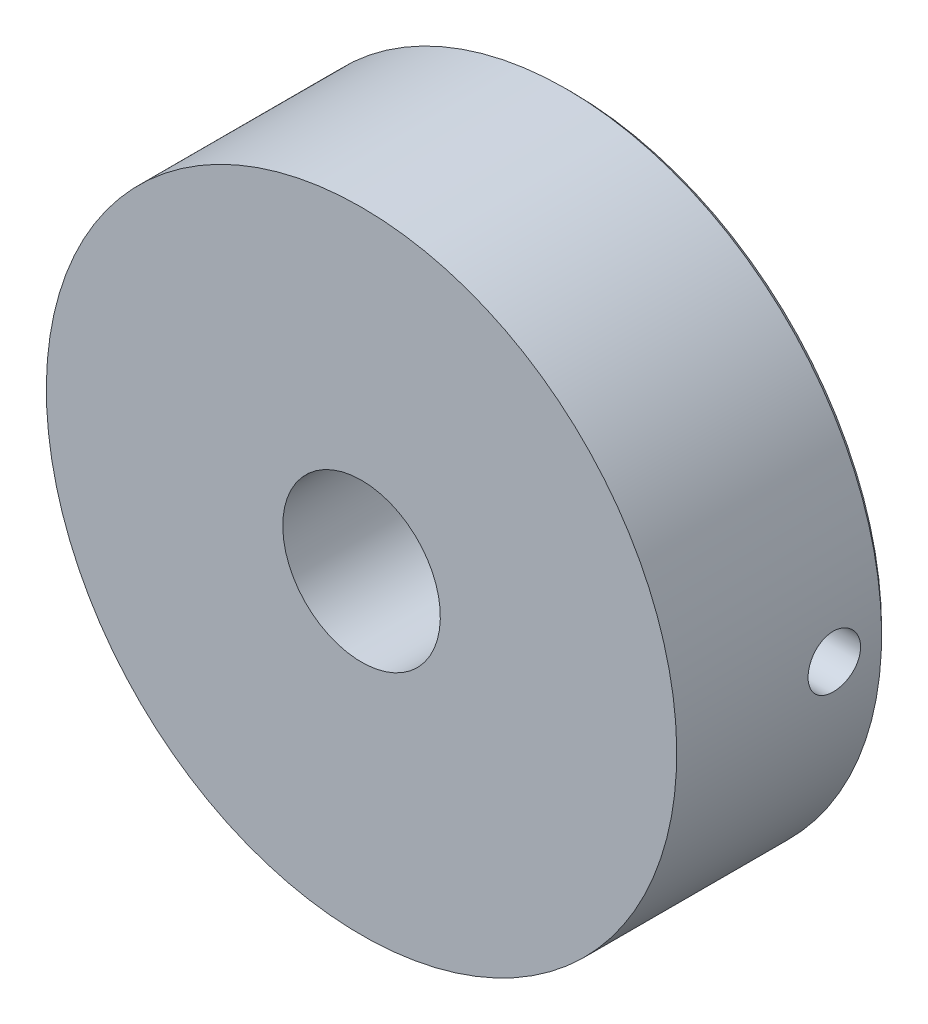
ISO-10303-21;
HEADER;
FILE_DESCRIPTION(('STEP AP214'),'2;1');
FILE_NAME('part.step','',(''),(''),'','','');
FILE_SCHEMA(('AUTOMOTIVE_DESIGN { 1 0 10303 214 1 1 1 1 }'));
ENDSEC;
DATA;
#1=APPLICATION_CONTEXT('core data for automotive mechanical design processes');
#2=APPLICATION_PROTOCOL_DEFINITION('international standard','automotive_design',2000,#1);
#3=PRODUCT_CONTEXT('',#1,'mechanical');
#4=PRODUCT('Part','Part','',(#3));
#5=PRODUCT_RELATED_PRODUCT_CATEGORY('part','',(#4));
#6=PRODUCT_DEFINITION_FORMATION('','',#4);
#7=PRODUCT_DEFINITION_CONTEXT('part definition',#1,'design');
#8=PRODUCT_DEFINITION('design','',#6,#7);
#9=PRODUCT_DEFINITION_SHAPE('','',#8);
#10=(LENGTH_UNIT() NAMED_UNIT(*) SI_UNIT(.MILLI.,.METRE.));
#11=(NAMED_UNIT(*) PLANE_ANGLE_UNIT() SI_UNIT($,.RADIAN.));
#12=(NAMED_UNIT(*) SI_UNIT($,.STERADIAN.) SOLID_ANGLE_UNIT());
#13=UNCERTAINTY_MEASURE_WITH_UNIT(LENGTH_MEASURE(1.E-05),#10,'distance_accuracy_value','');
#14=(GEOMETRIC_REPRESENTATION_CONTEXT(3) GLOBAL_UNCERTAINTY_ASSIGNED_CONTEXT((#13)) GLOBAL_UNIT_ASSIGNED_CONTEXT((#10,
#11,#12)) REPRESENTATION_CONTEXT('',''));
#15=CARTESIAN_POINT('',(0.,0.,0.));
#16=DIRECTION('',(0.,0.,1.));
#17=DIRECTION('',(1.,0.,0.));
#18=AXIS2_PLACEMENT_3D('',#15,#16,#17);
#19=CARTESIAN_POINT('',(0.,0.,20.));
#20=DIRECTION('',(0.,0.,1.));
#21=DIRECTION('',(0.,1.,0.));
#22=AXIS2_PLACEMENT_3D('',#19,#20,#21);
#23=PLANE('',#22);
#24=CARTESIAN_POINT('',(0.,0.,20.));
#25=DIRECTION('',(0.,0.,1.));
#26=DIRECTION('',(0.,1.,0.));
#27=AXIS2_PLACEMENT_3D('',#24,#25,#26);
#28=CIRCLE('',#27,30.);
#29=CARTESIAN_POINT('',(0.,30.,20.));
#30=VERTEX_POINT('',#29);
#31=EDGE_CURVE('E23',#30,#30,#28,.T.);
#32=ORIENTED_EDGE('',*,*,#31,.T.);
#33=EDGE_LOOP('',(#32));
#34=FACE_BOUND('',#33,.T.);
#35=CARTESIAN_POINT('',(0.,0.,20.));
#36=DIRECTION('',(0.,0.,1.));
#37=DIRECTION('',(0.,1.,0.));
#38=AXIS2_PLACEMENT_3D('',#35,#36,#37);
#39=CIRCLE('',#38,7.5);
#40=CARTESIAN_POINT('',(0.,7.5,20.));
#41=VERTEX_POINT('',#40);
#42=EDGE_CURVE('E27',#41,#41,#39,.T.);
#43=ORIENTED_EDGE('',*,*,#42,.F.);
#44=EDGE_LOOP('',(#43));
#45=FACE_BOUND('',#44,.T.);
#46=ADVANCED_FACE('F12',(#34,#45),#23,.T.);
#47=CARTESIAN_POINT('',(0.,0.,0.));
#48=DIRECTION('',(0.,0.,1.));
#49=DIRECTION('',(0.,1.,0.));
#50=AXIS2_PLACEMENT_3D('',#47,#48,#49);
#51=PLANE('',#50);
#52=CARTESIAN_POINT('',(0.,0.,0.));
#53=DIRECTION('',(0.,0.,1.));
#54=DIRECTION('',(0.,1.,0.));
#55=AXIS2_PLACEMENT_3D('',#52,#53,#54);
#56=CIRCLE('',#55,29.5);
#57=CARTESIAN_POINT('',(0.,29.5,0.));
#58=VERTEX_POINT('',#57);
#59=EDGE_CURVE('E8',#58,#58,#56,.F.);
#60=ORIENTED_EDGE('',*,*,#59,.T.);
#61=EDGE_LOOP('',(#60));
#62=FACE_BOUND('',#61,.T.);
#63=CARTESIAN_POINT('',(0.,0.,0.));
#64=DIRECTION('',(0.,0.,1.));
#65=DIRECTION('',(0.,1.,0.));
#66=AXIS2_PLACEMENT_3D('',#63,#64,#65);
#67=CIRCLE('',#66,7.5);
#68=CARTESIAN_POINT('',(0.,7.5,0.));
#69=VERTEX_POINT('',#68);
#70=EDGE_CURVE('E32',#69,#69,#67,.T.);
#71=ORIENTED_EDGE('',*,*,#70,.T.);
#72=EDGE_LOOP('',(#71));
#73=FACE_BOUND('',#72,.T.);
#74=ADVANCED_FACE('F66',(#62,#73),#51,.F.);
#75=CARTESIAN_POINT('',(0.,0.,20.));
#76=DIRECTION('',(0.,0.,-1.));
#77=DIRECTION('',(0.,-1.,0.));
#78=AXIS2_PLACEMENT_3D('',#75,#76,#77);
#79=CYLINDRICAL_SURFACE('',#78,30.);
#80=CARTESIAN_POINT('',(0.,0.,0.5));
#81=DIRECTION('',(0.,0.,1.));
#82=DIRECTION('',(0.,1.,0.));
#83=AXIS2_PLACEMENT_3D('',#80,#81,#82);
#84=CIRCLE('',#83,30.);
#85=CARTESIAN_POINT('',(0.,30.,0.5));
#86=VERTEX_POINT('',#85);
#87=EDGE_CURVE('E19',#86,#86,#84,.T.);
#88=ORIENTED_EDGE('',*,*,#87,.T.);
#89=EDGE_LOOP('',(#88));
#90=FACE_BOUND('',#89,.T.);
#91=CARTESIAN_POINT('',(30.,0.,7.5));
#92=CARTESIAN_POINT('',(29.9999986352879,-0.140165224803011,7.4999938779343));
#93=CARTESIAN_POINT('',(29.9990072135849,-0.280425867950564,7.48817257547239));
#94=CARTESIAN_POINT('',(29.9951475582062,-0.557066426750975,7.4411891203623));
#95=CARTESIAN_POINT('',(29.9922771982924,-0.693441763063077,7.40600052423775));
#96=CARTESIAN_POINT('',(29.9849840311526,-0.958265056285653,7.31330711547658));
#97=CARTESIAN_POINT('',(29.9805621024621,-1.08671745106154,7.25581492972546));
#98=CARTESIAN_POINT('',(29.9706616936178,-1.33211808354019,7.12016892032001));
#99=CARTESIAN_POINT('',(29.9651834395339,-1.44906877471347,7.04201951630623));
#100=CARTESIAN_POINT('',(29.9537694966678,-1.66847499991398,6.86706233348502));
#101=CARTESIAN_POINT('',(29.9478328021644,-1.7708971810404,6.77021279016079));
#102=CARTESIAN_POINT('',(29.9361795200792,-1.95805283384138,6.56069276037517));
#103=CARTESIAN_POINT('',(29.930462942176,-2.04278552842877,6.44802157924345));
#104=CARTESIAN_POINT('',(29.9198863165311,-2.19226980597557,6.20985470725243));
#105=CARTESIAN_POINT('',(29.9150275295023,-2.25699208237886,6.08434056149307));
#106=CARTESIAN_POINT('',(29.9067281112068,-2.36443108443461,5.82417926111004));
#107=CARTESIAN_POINT('',(29.9032874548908,-2.40714819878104,5.68953226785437));
#108=CARTESIAN_POINT('',(29.898222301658,-2.46926757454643,5.41526152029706));
#109=CARTESIAN_POINT('',(29.8965935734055,-2.48872416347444,5.2756501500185));
#110=CARTESIAN_POINT('',(29.8953233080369,-2.50393802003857,4.99513449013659));
#111=CARTESIAN_POINT('',(29.8956817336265,-2.49969573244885,4.85423022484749));
#112=CARTESIAN_POINT('',(29.8983414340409,-2.46767716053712,4.5755008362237));
#113=CARTESIAN_POINT('',(29.9006378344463,-2.43995992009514,4.43766887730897));
#114=CARTESIAN_POINT('',(29.9069070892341,-2.36186996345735,4.16862033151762));
#115=CARTESIAN_POINT('',(29.91087995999,-2.31149702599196,4.03740380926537));
#116=CARTESIAN_POINT('',(29.9200601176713,-2.18945947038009,3.78512273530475));
#117=CARTESIAN_POINT('',(29.9252689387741,-2.11776836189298,3.66407105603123));
#118=CARTESIAN_POINT('',(29.936332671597,-1.95514860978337,3.43569665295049));
#119=CARTESIAN_POINT('',(29.9421875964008,-1.86421957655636,3.32837420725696));
#120=CARTESIAN_POINT('',(29.9539055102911,-1.66537395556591,3.13016145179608));
#121=CARTESIAN_POINT('',(29.9597684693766,-1.55740632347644,3.03932233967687));
#122=CARTESIAN_POINT('',(29.9708247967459,-1.32772639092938,2.87705069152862));
#123=CARTESIAN_POINT('',(29.9760181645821,-1.20601408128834,2.80561816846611));
#124=CARTESIAN_POINT('',(29.985151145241,-0.952266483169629,2.68419059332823));
#125=CARTESIAN_POINT('',(29.9890906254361,-0.820230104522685,2.63419780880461));
#126=CARTESIAN_POINT('',(29.9952704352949,-0.549597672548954,2.55710466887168));
#127=CARTESIAN_POINT('',(29.9975108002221,-0.411001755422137,2.53000383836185));
#128=CARTESIAN_POINT('',(30.0000354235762,-0.131628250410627,2.49952808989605));
#129=CARTESIAN_POINT('',(30.0003255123,0.00914157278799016,2.49608245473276));
#130=CARTESIAN_POINT('',(29.9989324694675,0.289256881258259,2.51282965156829));
#131=CARTESIAN_POINT('',(29.9972493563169,0.428602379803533,2.53302226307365));
#132=CARTESIAN_POINT('',(29.992102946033,0.701711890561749,2.59641414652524));
#133=CARTESIAN_POINT('',(29.9886421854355,0.835483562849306,2.63958064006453));
#134=CARTESIAN_POINT('',(29.9803292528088,1.09388541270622,2.74766146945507));
#135=CARTESIAN_POINT('',(29.975477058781,1.21851544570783,2.81257614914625));
#136=CARTESIAN_POINT('',(29.9649106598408,1.45541804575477,2.96248837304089));
#137=CARTESIAN_POINT('',(29.9591944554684,1.56766087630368,3.04753276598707));
#138=CARTESIAN_POINT('',(29.9475489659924,1.77630273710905,3.23522264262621));
#139=CARTESIAN_POINT('',(29.9416196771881,1.87270149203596,3.33786843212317));
#140=CARTESIAN_POINT('',(29.9301990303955,2.04716136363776,3.55815423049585));
#141=CARTESIAN_POINT('',(29.9247087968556,2.1251763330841,3.6758308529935));
#142=CARTESIAN_POINT('',(29.914803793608,2.26033765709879,3.92265565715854));
#143=CARTESIAN_POINT('',(29.9103890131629,2.31748422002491,4.05180372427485));
#144=CARTESIAN_POINT('',(29.9031410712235,2.40920794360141,4.3177419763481));
#145=CARTESIAN_POINT('',(29.9003059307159,2.44381335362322,4.45452236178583));
#146=CARTESIAN_POINT('',(29.8965316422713,2.48956442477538,4.73197674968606));
#147=CARTESIAN_POINT('',(29.8955924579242,2.50071053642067,4.87265067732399));
#148=CARTESIAN_POINT('',(29.8957169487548,2.49922140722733,5.15344031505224));
#149=CARTESIAN_POINT('',(29.8967745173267,2.48665867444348,5.29355641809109));
#150=CARTESIAN_POINT('',(29.9007603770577,2.43825965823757,5.56968133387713));
#151=CARTESIAN_POINT('',(29.9036886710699,2.40242333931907,5.7056901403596));
#152=CARTESIAN_POINT('',(29.9110844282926,2.30851277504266,5.96974440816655));
#153=CARTESIAN_POINT('',(29.9155518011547,2.25043983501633,6.09779033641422));
#154=CARTESIAN_POINT('',(29.9255224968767,2.11371264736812,6.34232710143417));
#155=CARTESIAN_POINT('',(29.9310258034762,2.03505872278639,6.45881811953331));
#156=CARTESIAN_POINT('',(29.942468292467,1.85912985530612,6.67730934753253));
#157=CARTESIAN_POINT('',(29.9484087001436,1.76180123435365,6.77926627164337));
#158=CARTESIAN_POINT('',(29.960044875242,1.55138306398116,6.9654379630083));
#159=CARTESIAN_POINT('',(29.9657405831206,1.43828970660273,7.04964843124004));
#160=CARTESIAN_POINT('',(29.9762558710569,1.19933443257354,7.19804965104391));
#161=CARTESIAN_POINT('',(29.9810738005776,1.07344914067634,7.26220284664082));
#162=CARTESIAN_POINT('',(29.9892713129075,0.812739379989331,7.3683795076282));
#163=CARTESIAN_POINT('',(29.9926525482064,0.677925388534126,7.41042841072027));
#164=CARTESIAN_POINT('',(29.9967276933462,0.451930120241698,7.46049395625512));
#165=CARTESIAN_POINT('',(29.9979492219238,0.362202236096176,7.47528903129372));
#166=CARTESIAN_POINT('',(29.9995858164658,0.181662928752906,7.49504402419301));
#167=CARTESIAN_POINT('',(30.0000008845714,0.0908515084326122,7.50000396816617));
#168=CARTESIAN_POINT('',(30.,0.,7.5));
#169=B_SPLINE_CURVE_WITH_KNOTS('',3,(#91,#92,#93,#94,#95,#96,#97,#98,#99,#100,#101,#102,#103,
#104,#105,#106,#107,#108,#109,#110,#111,#112,#113,#114,#115,#116,#117,#118,#119,#120,#121,#122,
#123,#124,#125,#126,#127,#128,#129,#130,#131,#132,#133,#134,#135,#136,#137,#138,#139,#140,#141,
#142,#143,#144,#145,#146,#147,#148,#149,#150,#151,#152,#153,#154,#155,#156,#157,#158,#159,#160,
#161,#162,#163,#164,#165,#166,#167,#168),.UNSPECIFIED.,.T.,.F.,(4,2,2,2,2,2,2,2,2,2,2,2,2,2,2,2,
2,2,2,2,2,2,2,2,2,2,2,2,2,2,2,2,2,2,2,2,2,2,4),(0.,0.420163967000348,0.840804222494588,
1.26120668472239,1.68151927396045,2.10278167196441,2.52406257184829,2.94595757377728,
3.36784512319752,3.78874537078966,4.20963771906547,4.62947457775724,5.04931553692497,
5.46968039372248,5.8900537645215,6.31171127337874,6.73336906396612,7.15507143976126,
7.57676506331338,7.99719748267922,8.41762598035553,8.83745622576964,9.25729310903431,
9.67811687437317,10.0989479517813,10.5208244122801,10.9426966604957,11.3640391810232,
11.7853736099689,12.2054215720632,12.6254701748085,13.0454941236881,13.4655114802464,
13.886754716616,14.308099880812,14.7302293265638,15.1518719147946,15.4242121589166,
15.6965516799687),.UNSPECIFIED.);
#170=CARTESIAN_POINT('',(30.,0.,7.5));
#171=VERTEX_POINT('',#170);
#172=EDGE_CURVE('E35',#171,#171,#169,.T.);
#173=ORIENTED_EDGE('',*,*,#172,.F.);
#174=EDGE_LOOP('',(#173));
#175=FACE_BOUND('',#174,.T.);
#176=ORIENTED_EDGE('',*,*,#31,.F.);
#177=EDGE_LOOP('',(#176));
#178=FACE_BOUND('',#177,.T.);
#179=ADVANCED_FACE('F14',(#90,#175,#178),#79,.T.);
#180=CARTESIAN_POINT('',(0.,0.,20.));
#181=DIRECTION('',(0.,0.,-1.));
#182=DIRECTION('',(0.,-1.,0.));
#183=AXIS2_PLACEMENT_3D('',#180,#181,#182);
#184=CYLINDRICAL_SURFACE('',#183,7.5);
#185=CARTESIAN_POINT('',(7.5,0.,7.5));
#186=CARTESIAN_POINT('',(7.5000003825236,-0.136408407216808,7.5000006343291));
#187=CARTESIAN_POINT('',(7.49624423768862,-0.272812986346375,7.48879933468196));
#188=CARTESIAN_POINT('',(7.48163025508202,-0.541604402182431,7.44442722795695));
#189=CARTESIAN_POINT('',(7.47077168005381,-0.673990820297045,7.4112541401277));
#190=CARTESIAN_POINT('',(7.44313269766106,-0.930831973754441,7.32420189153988));
#191=CARTESIAN_POINT('',(7.42636219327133,-1.05529956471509,7.27035734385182));
#192=CARTESIAN_POINT('',(7.38861114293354,-1.29343734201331,7.14364706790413));
#193=CARTESIAN_POINT('',(7.36762976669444,-1.40710539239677,7.0707775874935));
#194=CARTESIAN_POINT('',(7.32285236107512,-1.62435418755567,6.90543548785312));
#195=CARTESIAN_POINT('',(7.29898891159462,-1.72750925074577,6.81242191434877));
#196=CARTESIAN_POINT('',(7.25150786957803,-1.91708173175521,6.61058211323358));
#197=CARTESIAN_POINT('',(7.22789033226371,-2.00349546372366,6.50175241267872));
#198=CARTESIAN_POINT('',(7.18283331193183,-2.15956235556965,6.26753721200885));
#199=CARTESIAN_POINT('',(7.1614759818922,-2.22866214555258,6.14176565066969));
#200=CARTESIAN_POINT('',(7.12438263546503,-2.34454718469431,5.87955976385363));
#201=CARTESIAN_POINT('',(7.10864490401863,-2.39133924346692,5.74312870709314));
#202=CARTESIAN_POINT('',(7.08528258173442,-2.45968365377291,5.46831694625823));
#203=CARTESIAN_POINT('',(7.07740239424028,-2.48203362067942,5.33015697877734));
#204=CARTESIAN_POINT('',(7.06989141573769,-2.50335280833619,5.0518406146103));
#205=CARTESIAN_POINT('',(7.07025807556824,-2.5023292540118,4.91168484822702));
#206=CARTESIAN_POINT('',(7.0789753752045,-2.47754975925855,4.64015842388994));
#207=CARTESIAN_POINT('',(7.08696039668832,-2.45483478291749,4.50867899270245));
#208=CARTESIAN_POINT('',(7.10941644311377,-2.38901540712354,4.25151645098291));
#209=CARTESIAN_POINT('',(7.12388824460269,-2.34590856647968,4.12583403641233));
#210=CARTESIAN_POINT('',(7.15794777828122,-2.23984764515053,3.8814681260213));
#211=CARTESIAN_POINT('',(7.17761414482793,-2.17658512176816,3.76292993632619));
#212=CARTESIAN_POINT('',(7.21981396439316,-2.03222276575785,3.53782272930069));
#213=CARTESIAN_POINT('',(7.24234824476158,-1.95111778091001,3.43125718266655));
#214=CARTESIAN_POINT('',(7.28918322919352,-1.76837333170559,3.22727100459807));
#215=CARTESIAN_POINT('',(7.31351473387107,-1.66588287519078,3.13061826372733));
#216=CARTESIAN_POINT('',(7.36017345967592,-1.44584892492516,2.95567183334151));
#217=CARTESIAN_POINT('',(7.38250048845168,-1.32830398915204,2.87737990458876));
#218=CARTESIAN_POINT('',(7.42292769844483,-1.07986903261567,2.74075924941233));
#219=CARTESIAN_POINT('',(7.44098375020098,-0.948858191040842,2.68263627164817));
#220=CARTESIAN_POINT('',(7.47051417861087,-0.67817270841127,2.58949206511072));
#221=CARTESIAN_POINT('',(7.48199084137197,-0.538501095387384,2.55446281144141));
#222=CARTESIAN_POINT('',(7.496690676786,-0.260959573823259,2.5098608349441));
#223=CARTESIAN_POINT('',(7.5002500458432,-0.123273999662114,2.49925047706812));
#224=CARTESIAN_POINT('',(7.49972256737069,0.151937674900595,2.50083168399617));
#225=CARTESIAN_POINT('',(7.49563701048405,0.289463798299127,2.51301939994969));
#226=CARTESIAN_POINT('',(7.4805006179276,0.55629966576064,2.55902976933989));
#227=CARTESIAN_POINT('',(7.46965496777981,0.68573201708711,2.59221551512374));
#228=CARTESIAN_POINT('',(7.44229617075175,0.937139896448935,2.67848361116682));
#229=CARTESIAN_POINT('',(7.42578230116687,1.05911447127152,2.73156849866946));
#230=CARTESIAN_POINT('',(7.38822328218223,1.29572074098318,2.85767607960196));
#231=CARTESIAN_POINT('',(7.36707036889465,1.41007489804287,2.93118648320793));
#232=CARTESIAN_POINT('',(7.32263134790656,1.62516207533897,3.09548537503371));
#233=CARTESIAN_POINT('',(7.29934458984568,1.72589091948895,3.18627914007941));
#234=CARTESIAN_POINT('',(7.25192119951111,1.91563126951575,3.38744687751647));
#235=CARTESIAN_POINT('',(7.2277940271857,2.00390242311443,3.49852306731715));
#236=CARTESIAN_POINT('',(7.18249933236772,2.16064380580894,3.73442891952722));
#237=CARTESIAN_POINT('',(7.16133183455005,2.22911386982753,3.85925869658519));
#238=CARTESIAN_POINT('',(7.12455979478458,2.3439923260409,4.11918253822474));
#239=CARTESIAN_POINT('',(7.10894401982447,2.39044533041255,4.25425519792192));
#240=CARTESIAN_POINT('',(7.08527080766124,2.45973666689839,4.53094662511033));
#241=CARTESIAN_POINT('',(7.07720996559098,2.48258563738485,4.67256241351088));
#242=CARTESIAN_POINT('',(7.06994647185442,2.50319070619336,4.9504927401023));
#243=CARTESIAN_POINT('',(7.07031000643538,2.502175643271,5.08670585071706));
#244=CARTESIAN_POINT('',(7.07878174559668,2.47810573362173,5.35691268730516));
#245=CARTESIAN_POINT('',(7.08688948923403,2.45505219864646,5.49090654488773));
#246=CARTESIAN_POINT('',(7.10961310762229,2.38842953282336,5.75033915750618));
#247=CARTESIAN_POINT('',(7.12410245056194,2.34525836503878,5.87589206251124));
#248=CARTESIAN_POINT('',(7.15790997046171,2.23994841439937,6.11806851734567));
#249=CARTESIAN_POINT('',(7.17722921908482,2.17780542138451,6.23469007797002));
#250=CARTESIAN_POINT('',(7.21957073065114,2.03315173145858,6.46120917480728));
#251=CARTESIAN_POINT('',(7.24271779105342,1.94987060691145,6.57059125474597));
#252=CARTESIAN_POINT('',(7.28958390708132,1.76660720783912,6.7742245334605));
#253=CARTESIAN_POINT('',(7.3133031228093,1.6666202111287,6.86847143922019));
#254=CARTESIAN_POINT('',(7.3597507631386,1.44810389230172,7.04286103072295));
#255=CARTESIAN_POINT('',(7.38240454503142,1.32900378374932,7.1223108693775));
#256=CARTESIAN_POINT('',(7.4231497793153,1.07839339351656,7.25997607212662));
#257=CARTESIAN_POINT('',(7.44124239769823,0.946886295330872,7.31819686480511));
#258=CARTESIAN_POINT('',(7.47013787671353,0.68123411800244,7.40930408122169));
#259=CARTESIAN_POINT('',(7.48123031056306,0.547469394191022,7.44320616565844));
#260=CARTESIAN_POINT('',(7.49616017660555,0.275801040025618,7.48855070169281));
#261=CARTESIAN_POINT('',(7.49999961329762,0.137898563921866,7.49999935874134));
#262=CARTESIAN_POINT('',(7.5,0.,7.5));
#263=B_SPLINE_CURVE_WITH_KNOTS('',3,(#185,#186,#187,#188,#189,#190,#191,#192,#193,#194,#195,
#196,#197,#198,#199,#200,#201,#202,#203,#204,#205,#206,#207,#208,#209,#210,#211,#212,#213,#214,
#215,#216,#217,#218,#219,#220,#221,#222,#223,#224,#225,#226,#227,#228,#229,#230,#231,#232,#233,
#234,#235,#236,#237,#238,#239,#240,#241,#242,#243,#244,#245,#246,#247,#248,#249,#250,#251,#252,
#253,#254,#255,#256,#257,#258,#259,#260,#261,#262),.UNSPECIFIED.,.T.,.F.,(4,2,2,2,2,2,2,2,2,2,2,
2,2,2,2,2,2,2,2,2,2,2,2,2,2,2,2,2,2,2,2,2,2,2,2,2,2,2,4),(0.,0.408717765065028,
0.817477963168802,1.22555668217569,1.63371594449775,2.0546171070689,2.47561083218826,
2.90870962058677,3.34167611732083,3.76004814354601,4.17829084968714,4.57742066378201,
4.97659827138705,5.38220427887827,5.78792756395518,6.21483264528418,6.64177864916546,
7.07296014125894,7.50399172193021,7.91633957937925,8.32861782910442,8.72895394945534,
9.1293411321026,9.54025999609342,9.95130452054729,10.3810255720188,10.8107502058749,
11.2396003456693,11.668257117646,12.0748916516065,12.4815019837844,12.8803896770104,
13.2793659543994,13.6957516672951,14.1122552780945,14.5449915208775,14.9776170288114,
15.3909139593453,15.8040966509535),.UNSPECIFIED.);
#264=CARTESIAN_POINT('',(7.5,0.,7.5));
#265=VERTEX_POINT('',#264);
#266=EDGE_CURVE('E43',#265,#265,#263,.T.);
#267=ORIENTED_EDGE('',*,*,#266,.T.);
#268=EDGE_LOOP('',(#267));
#269=FACE_BOUND('',#268,.T.);
#270=ORIENTED_EDGE('',*,*,#42,.T.);
#271=EDGE_LOOP('',(#270));
#272=FACE_BOUND('',#271,.T.);
#273=ORIENTED_EDGE('',*,*,#70,.F.);
#274=EDGE_LOOP('',(#273));
#275=FACE_BOUND('',#274,.T.);
#276=ADVANCED_FACE('F62',(#269,#272,#275),#184,.F.);
#277=CARTESIAN_POINT('',(30.001,0.,5.));
#278=DIRECTION('',(-1.,0.,0.));
#279=DIRECTION('',(0.,0.,1.));
#280=AXIS2_PLACEMENT_3D('',#277,#278,#279);
#281=CYLINDRICAL_SURFACE('',#280,2.5);
#282=ORIENTED_EDGE('',*,*,#266,.F.);
#283=EDGE_LOOP('',(#282));
#284=FACE_BOUND('',#283,.T.);
#285=ORIENTED_EDGE('',*,*,#172,.T.);
#286=EDGE_LOOP('',(#285));
#287=FACE_BOUND('',#286,.T.);
#288=ADVANCED_FACE('F48',(#284,#287),#281,.F.);
#289=CARTESIAN_POINT('',(0.,0.,0.5));
#290=DIRECTION('',(0.,0.,1.));
#291=DIRECTION('',(0.,1.,0.));
#292=AXIS2_PLACEMENT_3D('',#289,#290,#291);
#293=CONICAL_SURFACE('',#292,30.,0.785398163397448);
#294=ORIENTED_EDGE('',*,*,#59,.F.);
#295=EDGE_LOOP('',(#294));
#296=FACE_BOUND('',#295,.T.);
#297=ORIENTED_EDGE('',*,*,#87,.F.);
#298=EDGE_LOOP('',(#297));
#299=FACE_BOUND('',#298,.T.);
#300=ADVANCED_FACE('F54',(#296,#299),#293,.T.);
#301=CLOSED_SHELL('',(#46,#74,#179,#276,#288,#300));
#302=MANIFOLD_SOLID_BREP('B1',#301);
#303=ADVANCED_BREP_SHAPE_REPRESENTATION('',(#18,#302),#14);
#304=SHAPE_DEFINITION_REPRESENTATION(#9,#303);
ENDSEC;
END-ISO-10303-21;
